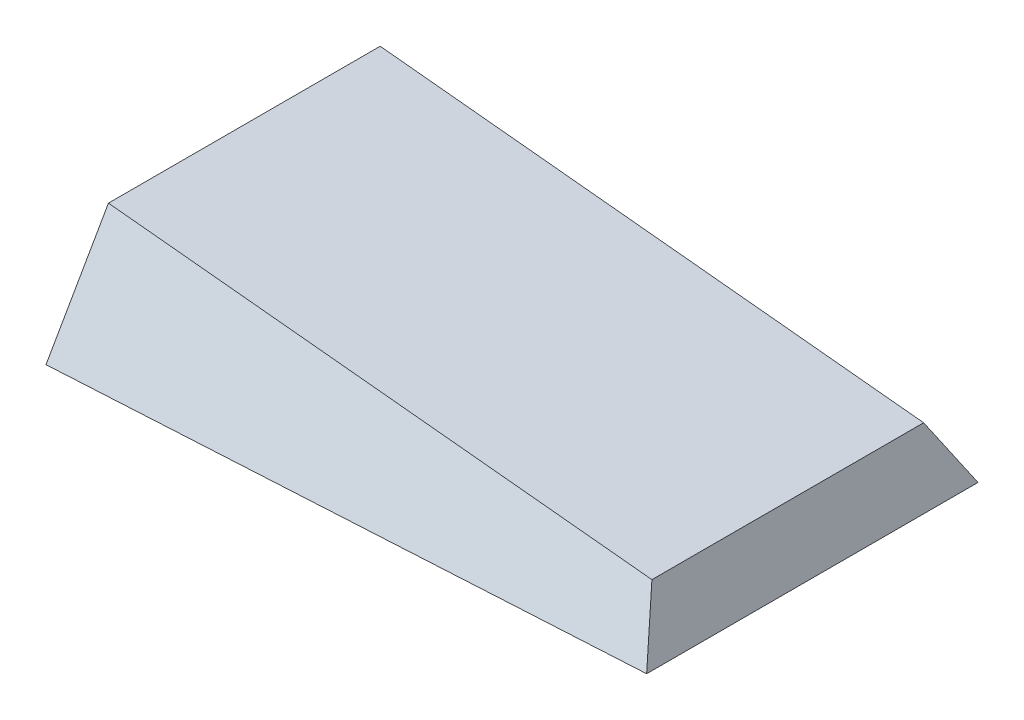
ISO-10303-21;
HEADER;
FILE_DESCRIPTION(('STEP AP214'),'2;1');
FILE_NAME('part.step','',(''),(''),'','','');
FILE_SCHEMA(('AUTOMOTIVE_DESIGN { 1 0 10303 214 1 1 1 1 }'));
ENDSEC;
DATA;
#1=APPLICATION_CONTEXT('core data for automotive mechanical design processes');
#2=APPLICATION_PROTOCOL_DEFINITION('international standard','automotive_design',2000,#1);
#3=PRODUCT_CONTEXT('',#1,'mechanical');
#4=PRODUCT('Part','Part','',(#3));
#5=PRODUCT_RELATED_PRODUCT_CATEGORY('part','',(#4));
#6=PRODUCT_DEFINITION_FORMATION('','',#4);
#7=PRODUCT_DEFINITION_CONTEXT('part definition',#1,'design');
#8=PRODUCT_DEFINITION('design','',#6,#7);
#9=PRODUCT_DEFINITION_SHAPE('','',#8);
#10=(LENGTH_UNIT() NAMED_UNIT(*) SI_UNIT(.MILLI.,.METRE.));
#11=(NAMED_UNIT(*) PLANE_ANGLE_UNIT() SI_UNIT($,.RADIAN.));
#12=(NAMED_UNIT(*) SI_UNIT($,.STERADIAN.) SOLID_ANGLE_UNIT());
#13=UNCERTAINTY_MEASURE_WITH_UNIT(LENGTH_MEASURE(1.E-05),#10,'distance_accuracy_value','');
#14=(GEOMETRIC_REPRESENTATION_CONTEXT(3) GLOBAL_UNCERTAINTY_ASSIGNED_CONTEXT((#13)) GLOBAL_UNIT_ASSIGNED_CONTEXT((#10,
#11,#12)) REPRESENTATION_CONTEXT('',''));
#15=CARTESIAN_POINT('',(0.,0.,0.));
#16=DIRECTION('',(0.,0.,1.));
#17=DIRECTION('',(1.,0.,0.));
#18=AXIS2_PLACEMENT_3D('',#15,#16,#17);
#19=CARTESIAN_POINT('',(0.,10.,25.));
#20=DIRECTION('',(0.911479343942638,0.411345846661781,0.));
#21=DIRECTION('',(-0.411345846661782,0.911479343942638,0.));
#22=AXIS2_PLACEMENT_3D('',#19,#20,#21);
#23=PLANE('',#22);
#24=DIRECTION('',(0.367918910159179,-0.81525190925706,-0.447213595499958));
#25=VECTOR('',#24,1.);
#26=CARTESIAN_POINT('',(-16.5358983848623,46.6410161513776,-4.90024875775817));
#27=LINE('',#26,#25);
#28=CARTESIAN_POINT('',(4.51294754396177,0.,-30.4855878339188));
#29=VERTEX_POINT('',#28);
#30=CARTESIAN_POINT('',(0.,10.,-25.));
#31=VERTEX_POINT('',#30);
#32=EDGE_CURVE('E77',#29,#31,#27,.F.);
#33=ORIENTED_EDGE('',*,*,#32,.T.);
#34=DIRECTION('',(0.,0.,-1.));
#35=VECTOR('',#34,1.);
#36=CARTESIAN_POINT('',(0.,10.,25.));
#37=LINE('',#36,#35);
#38=CARTESIAN_POINT('',(0.,10.,25.));
#39=VERTEX_POINT('',#38);
#40=EDGE_CURVE('E11',#39,#31,#37,.T.);
#41=ORIENTED_EDGE('',*,*,#40,.F.);
#42=DIRECTION('',(-0.367918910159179,0.81525190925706,-0.447213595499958));
#43=VECTOR('',#42,1.);
#44=CARTESIAN_POINT('',(-16.5358983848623,46.6410161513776,4.90024875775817));
#45=LINE('',#44,#43);
#46=CARTESIAN_POINT('',(4.51294754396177,0.,30.4855878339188));
#47=VERTEX_POINT('',#46);
#48=EDGE_CURVE('E93',#47,#39,#45,.T.);
#49=ORIENTED_EDGE('',*,*,#48,.F.);
#50=DIRECTION('',(0.,0.,1.));
#51=VECTOR('',#50,1.);
#52=CARTESIAN_POINT('',(4.51294754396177,0.,25.));
#53=LINE('',#52,#51);
#54=EDGE_CURVE('E89',#47,#29,#53,.F.);
#55=ORIENTED_EDGE('',*,*,#54,.T.);
#56=EDGE_LOOP('',(#33,#41,#49,#55));
#57=FACE_BOUND('',#56,.T.);
#58=ADVANCED_FACE('F33',(#57),#23,.T.);
#59=CARTESIAN_POINT('',(-100.,20.,25.));
#60=DIRECTION('',(-0.0995037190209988,-0.995037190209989,0.));
#61=DIRECTION('',(0.995037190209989,-0.0995037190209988,0.));
#62=AXIS2_PLACEMENT_3D('',#59,#60,#61);
#63=PLANE('',#62);
#64=DIRECTION('',(-0.995037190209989,0.0995037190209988,0.));
#65=VECTOR('',#64,1.);
#66=CARTESIAN_POINT('',(-100.,20.,-25.));
#67=LINE('',#66,#65);
#68=CARTESIAN_POINT('',(-100.,20.,-25.));
#69=VERTEX_POINT('',#68);
#70=EDGE_CURVE('E73',#31,#69,#67,.T.);
#71=ORIENTED_EDGE('',*,*,#70,.T.);
#72=DIRECTION('',(0.,0.,-1.));
#73=VECTOR('',#72,1.);
#74=CARTESIAN_POINT('',(-100.,20.,25.));
#75=LINE('',#74,#73);
#76=CARTESIAN_POINT('',(-100.,20.,25.));
#77=VERTEX_POINT('',#76);
#78=EDGE_CURVE('E43',#77,#69,#75,.T.);
#79=ORIENTED_EDGE('',*,*,#78,.F.);
#80=DIRECTION('',(-0.995037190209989,0.0995037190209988,0.));
#81=VECTOR('',#80,1.);
#82=CARTESIAN_POINT('',(-100.,20.,25.));
#83=LINE('',#82,#81);
#84=EDGE_CURVE('E85',#39,#77,#83,.T.);
#85=ORIENTED_EDGE('',*,*,#84,.F.);
#86=ORIENTED_EDGE('',*,*,#40,.T.);
#87=EDGE_LOOP('',(#71,#79,#85,#86));
#88=FACE_BOUND('',#87,.T.);
#89=ADVANCED_FACE('F84',(#88),#63,.F.);
#90=CARTESIAN_POINT('',(-100.,0.,25.));
#91=DIRECTION('',(1.,0.,0.));
#92=DIRECTION('',(0.,0.,-1.));
#93=AXIS2_PLACEMENT_3D('',#90,#91,#92);
#94=PLANE('',#93);
#95=DIRECTION('',(0.,-0.867099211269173,-0.498135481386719));
#96=VECTOR('',#95,1.);
#97=CARTESIAN_POINT('',(-100.,20.,-25.));
#98=LINE('',#97,#96);
#99=CARTESIAN_POINT('',(-100.,0.,-36.4896997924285));
#100=VERTEX_POINT('',#99);
#101=EDGE_CURVE('E78',#69,#100,#98,.T.);
#102=ORIENTED_EDGE('',*,*,#101,.T.);
#103=DIRECTION('',(0.,0.,-1.));
#104=VECTOR('',#103,1.);
#105=CARTESIAN_POINT('',(-100.,0.,25.));
#106=LINE('',#105,#104);
#107=CARTESIAN_POINT('',(-100.,0.,36.4896997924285));
#108=VERTEX_POINT('',#107);
#109=EDGE_CURVE('E98',#108,#100,#106,.T.);
#110=ORIENTED_EDGE('',*,*,#109,.F.);
#111=DIRECTION('',(0.,0.867099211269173,-0.498135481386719));
#112=VECTOR('',#111,1.);
#113=CARTESIAN_POINT('',(-100.,20.,25.));
#114=LINE('',#113,#112);
#115=EDGE_CURVE('E37',#77,#108,#114,.F.);
#116=ORIENTED_EDGE('',*,*,#115,.F.);
#117=ORIENTED_EDGE('',*,*,#78,.T.);
#118=EDGE_LOOP('',(#102,#110,#116,#117));
#119=FACE_BOUND('',#118,.T.);
#120=ADVANCED_FACE('F105',(#119),#94,.F.);
#121=CARTESIAN_POINT('',(0.,0.,25.));
#122=DIRECTION('',(0.,1.,0.));
#123=DIRECTION('',(-1.,0.,0.));
#124=AXIS2_PLACEMENT_3D('',#121,#122,#123);
#125=PLANE('',#124);
#126=DIRECTION('',(0.998353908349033,0.,0.0573539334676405));
#127=VECTOR('',#126,1.);
#128=CARTESIAN_POINT('',(-99.3421052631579,0.,-36.4519047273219));
#129=LINE('',#128,#127);
#130=EDGE_CURVE('E95',#100,#29,#129,.T.);
#131=ORIENTED_EDGE('',*,*,#130,.T.);
#132=ORIENTED_EDGE('',*,*,#54,.F.);
#133=DIRECTION('',(-0.998353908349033,0.,0.0573539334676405));
#134=VECTOR('',#133,1.);
#135=CARTESIAN_POINT('',(-99.3421052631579,0.,36.4519047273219));
#136=LINE('',#135,#134);
#137=EDGE_CURVE('E50',#108,#47,#136,.F.);
#138=ORIENTED_EDGE('',*,*,#137,.F.);
#139=ORIENTED_EDGE('',*,*,#109,.T.);
#140=EDGE_LOOP('',(#131,#132,#138,#139));
#141=FACE_BOUND('',#140,.T.);
#142=ADVANCED_FACE('F107',(#141),#125,.F.);
#143=CARTESIAN_POINT('',(-100.,20.,25.));
#144=DIRECTION('',(0.0497518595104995,0.497518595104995,0.866025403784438));
#145=DIRECTION('',(0.,-0.867099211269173,0.498135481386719));
#146=AXIS2_PLACEMENT_3D('',#143,#144,#145);
#147=PLANE('',#146);
#148=ORIENTED_EDGE('',*,*,#48,.T.);
#149=ORIENTED_EDGE('',*,*,#84,.T.);
#150=ORIENTED_EDGE('',*,*,#115,.T.);
#151=ORIENTED_EDGE('',*,*,#137,.T.);
#152=EDGE_LOOP('',(#148,#149,#150,#151));
#153=FACE_BOUND('',#152,.T.);
#154=ADVANCED_FACE('F35',(#153),#147,.T.);
#155=CARTESIAN_POINT('',(-100.,20.,-25.));
#156=DIRECTION('',(0.0497518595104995,0.497518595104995,-0.866025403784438));
#157=DIRECTION('',(0.,0.867099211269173,0.498135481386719));
#158=AXIS2_PLACEMENT_3D('',#155,#156,#157);
#159=PLANE('',#158);
#160=ORIENTED_EDGE('',*,*,#32,.F.);
#161=ORIENTED_EDGE('',*,*,#130,.F.);
#162=ORIENTED_EDGE('',*,*,#101,.F.);
#163=ORIENTED_EDGE('',*,*,#70,.F.);
#164=EDGE_LOOP('',(#160,#161,#162,#163));
#165=FACE_BOUND('',#164,.T.);
#166=ADVANCED_FACE('F74',(#165),#159,.T.);
#167=CLOSED_SHELL('',(#58,#89,#120,#142,#154,#166));
#168=MANIFOLD_SOLID_BREP('B2',#167);
#169=ADVANCED_BREP_SHAPE_REPRESENTATION('',(#18,#168),#14);
#170=SHAPE_DEFINITION_REPRESENTATION(#9,#169);
ENDSEC;
END-ISO-10303-21;
